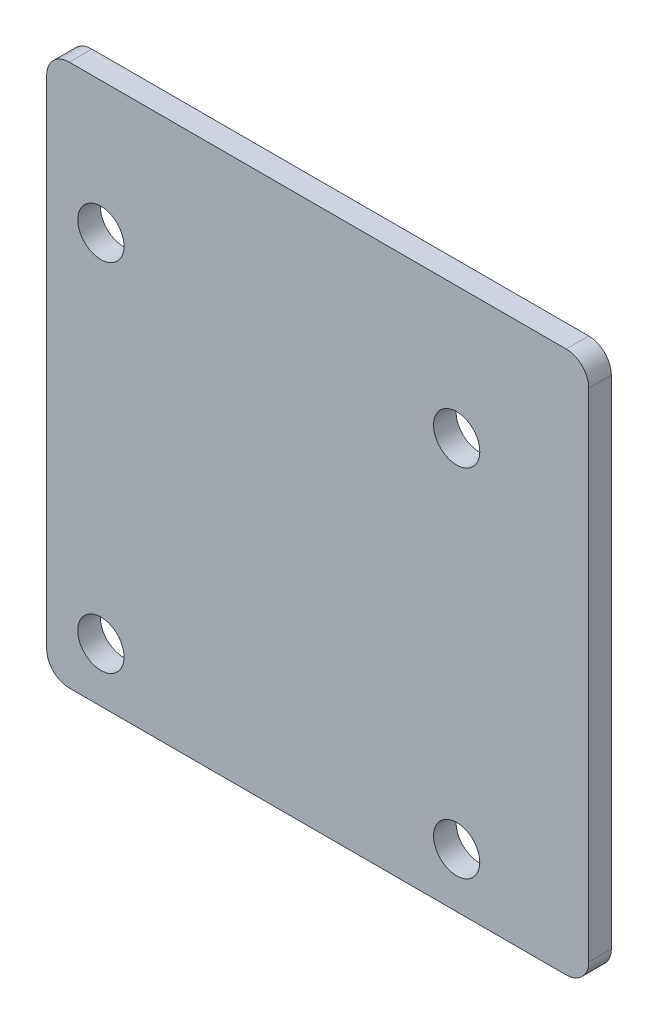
ISO-10303-21;
HEADER;
FILE_DESCRIPTION(('STEP AP214'),'2;1');
FILE_NAME('part.step','',(''),(''),'','','');
FILE_SCHEMA(('AUTOMOTIVE_DESIGN { 1 0 10303 214 1 1 1 1 }'));
ENDSEC;
DATA;
#1=APPLICATION_CONTEXT('core data for automotive mechanical design processes');
#2=APPLICATION_PROTOCOL_DEFINITION('international standard','automotive_design',2000,#1);
#3=PRODUCT_CONTEXT('',#1,'mechanical');
#4=PRODUCT('Part','Part','',(#3));
#5=PRODUCT_RELATED_PRODUCT_CATEGORY('part','',(#4));
#6=PRODUCT_DEFINITION_FORMATION('','',#4);
#7=PRODUCT_DEFINITION_CONTEXT('part definition',#1,'design');
#8=PRODUCT_DEFINITION('design','',#6,#7);
#9=PRODUCT_DEFINITION_SHAPE('','',#8);
#10=(LENGTH_UNIT() NAMED_UNIT(*) SI_UNIT(.MILLI.,.METRE.));
#11=(NAMED_UNIT(*) PLANE_ANGLE_UNIT() SI_UNIT($,.RADIAN.));
#12=(NAMED_UNIT(*) SI_UNIT($,.STERADIAN.) SOLID_ANGLE_UNIT());
#13=UNCERTAINTY_MEASURE_WITH_UNIT(LENGTH_MEASURE(1.E-05),#10,'distance_accuracy_value','');
#14=(GEOMETRIC_REPRESENTATION_CONTEXT(3) GLOBAL_UNCERTAINTY_ASSIGNED_CONTEXT((#13)) GLOBAL_UNIT_ASSIGNED_CONTEXT((#10,
#11,#12)) REPRESENTATION_CONTEXT('',''));
#15=CARTESIAN_POINT('',(0.,0.,0.));
#16=DIRECTION('',(0.,0.,1.));
#17=DIRECTION('',(1.,0.,0.));
#18=AXIS2_PLACEMENT_3D('',#15,#16,#17);
#19=CARTESIAN_POINT('',(-73.025,34.925,-3.175));
#20=DIRECTION('',(0.,0.,-1.));
#21=DIRECTION('',(-1.,0.,0.));
#22=AXIS2_PLACEMENT_3D('',#19,#20,#21);
#23=PLANE('',#22);
#24=CARTESIAN_POINT('',(-18.5674,-30.48,-3.17500000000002));
#25=DIRECTION('',(0.,0.,1.));
#26=DIRECTION('',(1.,0.,0.));
#27=AXIS2_PLACEMENT_3D('',#24,#25,#26);
#28=CIRCLE('',#27,3.2512);
#29=CARTESIAN_POINT('',(-15.3162,-30.48,-3.17500000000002));
#30=VERTEX_POINT('',#29);
#31=EDGE_CURVE('E210',#30,#30,#28,.T.);
#32=ORIENTED_EDGE('',*,*,#31,.T.);
#33=EDGE_LOOP('',(#32));
#34=FACE_BOUND('',#33,.T.);
#35=CARTESIAN_POINT('',(-18.5674,19.5326,-3.17500000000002));
#36=DIRECTION('',(0.,0.,1.));
#37=DIRECTION('',(1.,0.,0.));
#38=AXIS2_PLACEMENT_3D('',#35,#36,#37);
#39=CIRCLE('',#38,3.2512);
#40=CARTESIAN_POINT('',(-15.3162,19.5326,-3.17500000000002));
#41=VERTEX_POINT('',#40);
#42=EDGE_CURVE('E204',#41,#41,#39,.T.);
#43=ORIENTED_EDGE('',*,*,#42,.T.);
#44=EDGE_LOOP('',(#43));
#45=FACE_BOUND('',#44,.T.);
#46=CARTESIAN_POINT('',(-73.025,34.925,-3.175));
#47=DIRECTION('',(0.,0.,-1.));
#48=DIRECTION('',(-1.,0.,0.));
#49=AXIS2_PLACEMENT_3D('',#46,#47,#48);
#50=CIRCLE('',#49,3.17500000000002);
#51=CARTESIAN_POINT('',(-76.2,34.925,-3.175));
#52=VERTEX_POINT('',#51);
#53=CARTESIAN_POINT('',(-73.025,38.1,-3.175));
#54=VERTEX_POINT('',#53);
#55=EDGE_CURVE('E156',#52,#54,#50,.T.);
#56=ORIENTED_EDGE('',*,*,#55,.T.);
#57=DIRECTION('',(1.,0.,0.));
#58=VECTOR('',#57,1.);
#59=CARTESIAN_POINT('',(-3.17499999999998,38.1,-3.175));
#60=LINE('',#59,#58);
#61=CARTESIAN_POINT('',(-3.17499999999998,38.1,-3.175));
#62=VERTEX_POINT('',#61);
#63=EDGE_CURVE('E104',#54,#62,#60,.T.);
#64=ORIENTED_EDGE('',*,*,#63,.T.);
#65=CARTESIAN_POINT('',(-3.17499999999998,34.925,-3.175));
#66=DIRECTION('',(0.,0.,-1.));
#67=DIRECTION('',(1.,0.,0.));
#68=AXIS2_PLACEMENT_3D('',#65,#66,#67);
#69=CIRCLE('',#68,3.175);
#70=CARTESIAN_POINT('',(0.,34.925,-3.175));
#71=VERTEX_POINT('',#70);
#72=EDGE_CURVE('E171',#62,#71,#69,.T.);
#73=ORIENTED_EDGE('',*,*,#72,.T.);
#74=DIRECTION('',(0.,-1.,0.));
#75=VECTOR('',#74,1.);
#76=CARTESIAN_POINT('',(0.,-34.925,-3.175));
#77=LINE('',#76,#75);
#78=CARTESIAN_POINT('',(0.,-34.925,-3.175));
#79=VERTEX_POINT('',#78);
#80=EDGE_CURVE('E184',#71,#79,#77,.T.);
#81=ORIENTED_EDGE('',*,*,#80,.T.);
#82=CARTESIAN_POINT('',(-3.175,-34.925,-3.175));
#83=DIRECTION('',(0.,0.,-1.));
#84=DIRECTION('',(-1.,0.,0.));
#85=AXIS2_PLACEMENT_3D('',#82,#83,#84);
#86=CIRCLE('',#85,3.175);
#87=CARTESIAN_POINT('',(-3.175,-38.1,-3.175));
#88=VERTEX_POINT('',#87);
#89=EDGE_CURVE('E123',#79,#88,#86,.T.);
#90=ORIENTED_EDGE('',*,*,#89,.T.);
#91=DIRECTION('',(-1.,0.,0.));
#92=VECTOR('',#91,1.);
#93=CARTESIAN_POINT('',(-3.175,-38.1,-3.175));
#94=LINE('',#93,#92);
#95=CARTESIAN_POINT('',(-73.025,-38.1,-3.175));
#96=VERTEX_POINT('',#95);
#97=EDGE_CURVE('E117',#88,#96,#94,.T.);
#98=ORIENTED_EDGE('',*,*,#97,.T.);
#99=CARTESIAN_POINT('',(-73.025,-34.925,-3.175));
#100=DIRECTION('',(0.,0.,-1.));
#101=DIRECTION('',(-1.,0.,0.));
#102=AXIS2_PLACEMENT_3D('',#99,#100,#101);
#103=CIRCLE('',#102,3.17500000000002);
#104=CARTESIAN_POINT('',(-76.2,-34.925,-3.175));
#105=VERTEX_POINT('',#104);
#106=EDGE_CURVE('E121',#96,#105,#103,.T.);
#107=ORIENTED_EDGE('',*,*,#106,.T.);
#108=DIRECTION('',(0.,1.,0.));
#109=VECTOR('',#108,1.);
#110=CARTESIAN_POINT('',(-76.2,-34.925,-3.175));
#111=LINE('',#110,#109);
#112=EDGE_CURVE('E61',#105,#52,#111,.T.);
#113=ORIENTED_EDGE('',*,*,#112,.T.);
#114=EDGE_LOOP('',(#56,#64,#73,#81,#90,#98,#107,#113));
#115=FACE_BOUND('',#114,.T.);
#116=CARTESIAN_POINT('',(-68.58,-30.48,-3.17500000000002));
#117=DIRECTION('',(0.,0.,1.));
#118=DIRECTION('',(1.,0.,0.));
#119=AXIS2_PLACEMENT_3D('',#116,#117,#118);
#120=CIRCLE('',#119,3.2512);
#121=CARTESIAN_POINT('',(-65.3288,-30.48,-3.17500000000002));
#122=VERTEX_POINT('',#121);
#123=EDGE_CURVE('E192',#122,#122,#120,.T.);
#124=ORIENTED_EDGE('',*,*,#123,.T.);
#125=EDGE_LOOP('',(#124));
#126=FACE_BOUND('',#125,.T.);
#127=CARTESIAN_POINT('',(-68.58,19.5326,-3.17500000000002));
#128=DIRECTION('',(0.,0.,1.));
#129=DIRECTION('',(1.,0.,0.));
#130=AXIS2_PLACEMENT_3D('',#127,#128,#129);
#131=CIRCLE('',#130,3.2512);
#132=CARTESIAN_POINT('',(-65.3288,19.5326,-3.17500000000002));
#133=VERTEX_POINT('',#132);
#134=EDGE_CURVE('E198',#133,#133,#131,.T.);
#135=ORIENTED_EDGE('',*,*,#134,.T.);
#136=EDGE_LOOP('',(#135));
#137=FACE_BOUND('',#136,.T.);
#138=ADVANCED_FACE('F44',(#34,#45,#115,#126,#137),#23,.T.);
#139=CARTESIAN_POINT('',(-73.025,34.925,0.));
#140=DIRECTION('',(0.,0.,-1.));
#141=DIRECTION('',(-1.,0.,0.));
#142=AXIS2_PLACEMENT_3D('',#139,#140,#141);
#143=PLANE('',#142);
#144=CARTESIAN_POINT('',(-18.5674,-30.48,0.));
#145=DIRECTION('',(0.,0.,1.));
#146=DIRECTION('',(1.,0.,0.));
#147=AXIS2_PLACEMENT_3D('',#144,#145,#146);
#148=CIRCLE('',#147,3.2512);
#149=CARTESIAN_POINT('',(-15.3162,-30.48,0.));
#150=VERTEX_POINT('',#149);
#151=EDGE_CURVE('E207',#150,#150,#148,.T.);
#152=ORIENTED_EDGE('',*,*,#151,.F.);
#153=EDGE_LOOP('',(#152));
#154=FACE_BOUND('',#153,.T.);
#155=CARTESIAN_POINT('',(-18.5674,19.5326,0.));
#156=DIRECTION('',(0.,0.,1.));
#157=DIRECTION('',(1.,0.,0.));
#158=AXIS2_PLACEMENT_3D('',#155,#156,#157);
#159=CIRCLE('',#158,3.2512);
#160=CARTESIAN_POINT('',(-15.3162,19.5326,0.));
#161=VERTEX_POINT('',#160);
#162=EDGE_CURVE('E201',#161,#161,#159,.T.);
#163=ORIENTED_EDGE('',*,*,#162,.F.);
#164=EDGE_LOOP('',(#163));
#165=FACE_BOUND('',#164,.T.);
#166=CARTESIAN_POINT('',(-68.58,19.5326,0.));
#167=DIRECTION('',(0.,0.,1.));
#168=DIRECTION('',(1.,0.,0.));
#169=AXIS2_PLACEMENT_3D('',#166,#167,#168);
#170=CIRCLE('',#169,3.2512);
#171=CARTESIAN_POINT('',(-65.3288,19.5326,0.));
#172=VERTEX_POINT('',#171);
#173=EDGE_CURVE('E195',#172,#172,#170,.T.);
#174=ORIENTED_EDGE('',*,*,#173,.F.);
#175=EDGE_LOOP('',(#174));
#176=FACE_BOUND('',#175,.T.);
#177=CARTESIAN_POINT('',(-73.025,34.925,0.));
#178=DIRECTION('',(0.,0.,-1.));
#179=DIRECTION('',(-1.,0.,0.));
#180=AXIS2_PLACEMENT_3D('',#177,#178,#179);
#181=CIRCLE('',#180,3.17500000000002);
#182=CARTESIAN_POINT('',(-76.2,34.925,0.));
#183=VERTEX_POINT('',#182);
#184=CARTESIAN_POINT('',(-73.025,38.1,0.));
#185=VERTEX_POINT('',#184);
#186=EDGE_CURVE('E141',#183,#185,#181,.T.);
#187=ORIENTED_EDGE('',*,*,#186,.F.);
#188=DIRECTION('',(0.,1.,0.));
#189=VECTOR('',#188,1.);
#190=CARTESIAN_POINT('',(-76.2,-34.925,0.));
#191=LINE('',#190,#189);
#192=CARTESIAN_POINT('',(-76.2,-34.925,0.));
#193=VERTEX_POINT('',#192);
#194=EDGE_CURVE('E96',#193,#183,#191,.T.);
#195=ORIENTED_EDGE('',*,*,#194,.F.);
#196=CARTESIAN_POINT('',(-73.025,-34.925,0.));
#197=DIRECTION('',(0.,0.,-1.));
#198=DIRECTION('',(-1.,0.,0.));
#199=AXIS2_PLACEMENT_3D('',#196,#197,#198);
#200=CIRCLE('',#199,3.17500000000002);
#201=CARTESIAN_POINT('',(-73.025,-38.1,0.));
#202=VERTEX_POINT('',#201);
#203=EDGE_CURVE('E90',#202,#193,#200,.T.);
#204=ORIENTED_EDGE('',*,*,#203,.F.);
#205=DIRECTION('',(-1.,0.,0.));
#206=VECTOR('',#205,1.);
#207=CARTESIAN_POINT('',(-3.175,-38.1,0.));
#208=LINE('',#207,#206);
#209=CARTESIAN_POINT('',(-3.175,-38.1,0.));
#210=VERTEX_POINT('',#209);
#211=EDGE_CURVE('E131',#210,#202,#208,.T.);
#212=ORIENTED_EDGE('',*,*,#211,.F.);
#213=CARTESIAN_POINT('',(-3.175,-34.925,0.));
#214=DIRECTION('',(0.,0.,-1.));
#215=DIRECTION('',(-1.,0.,0.));
#216=AXIS2_PLACEMENT_3D('',#213,#214,#215);
#217=CIRCLE('',#216,3.175);
#218=CARTESIAN_POINT('',(0.,-34.925,0.));
#219=VERTEX_POINT('',#218);
#220=EDGE_CURVE('E151',#219,#210,#217,.T.);
#221=ORIENTED_EDGE('',*,*,#220,.F.);
#222=DIRECTION('',(0.,-1.,0.));
#223=VECTOR('',#222,1.);
#224=CARTESIAN_POINT('',(0.,-34.925,0.));
#225=LINE('',#224,#223);
#226=CARTESIAN_POINT('',(0.,34.925,0.));
#227=VERTEX_POINT('',#226);
#228=EDGE_CURVE('E149',#227,#219,#225,.T.);
#229=ORIENTED_EDGE('',*,*,#228,.F.);
#230=CARTESIAN_POINT('',(-3.17499999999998,34.925,0.));
#231=DIRECTION('',(0.,0.,-1.));
#232=DIRECTION('',(1.,0.,0.));
#233=AXIS2_PLACEMENT_3D('',#230,#231,#232);
#234=CIRCLE('',#233,3.175);
#235=CARTESIAN_POINT('',(-3.17499999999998,38.1,0.));
#236=VERTEX_POINT('',#235);
#237=EDGE_CURVE('E147',#236,#227,#234,.T.);
#238=ORIENTED_EDGE('',*,*,#237,.F.);
#239=DIRECTION('',(1.,0.,0.));
#240=VECTOR('',#239,1.);
#241=CARTESIAN_POINT('',(-3.17499999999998,38.1,0.));
#242=LINE('',#241,#240);
#243=EDGE_CURVE('E144',#185,#236,#242,.T.);
#244=ORIENTED_EDGE('',*,*,#243,.F.);
#245=EDGE_LOOP('',(#187,#195,#204,#212,#221,#229,#238,#244));
#246=FACE_BOUND('',#245,.T.);
#247=CARTESIAN_POINT('',(-68.58,-30.48,0.));
#248=DIRECTION('',(0.,0.,1.));
#249=DIRECTION('',(1.,0.,0.));
#250=AXIS2_PLACEMENT_3D('',#247,#248,#249);
#251=CIRCLE('',#250,3.2512);
#252=CARTESIAN_POINT('',(-65.3288,-30.48,0.));
#253=VERTEX_POINT('',#252);
#254=EDGE_CURVE('E145',#253,#253,#251,.T.);
#255=ORIENTED_EDGE('',*,*,#254,.F.);
#256=EDGE_LOOP('',(#255));
#257=FACE_BOUND('',#256,.T.);
#258=ADVANCED_FACE('F175',(#154,#165,#176,#246,#257),#143,.F.);
#259=CARTESIAN_POINT('',(-73.025,34.925,-3.175));
#260=DIRECTION('',(0.,0.,1.));
#261=DIRECTION('',(1.,0.,0.));
#262=AXIS2_PLACEMENT_3D('',#259,#260,#261);
#263=CYLINDRICAL_SURFACE('',#262,3.17500000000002);
#264=ORIENTED_EDGE('',*,*,#186,.T.);
#265=DIRECTION('',(0.,0.,1.));
#266=VECTOR('',#265,1.);
#267=CARTESIAN_POINT('',(-73.025,38.1,-3.175));
#268=LINE('',#267,#266);
#269=EDGE_CURVE('E13',#54,#185,#268,.T.);
#270=ORIENTED_EDGE('',*,*,#269,.F.);
#271=ORIENTED_EDGE('',*,*,#55,.F.);
#272=DIRECTION('',(0.,0.,1.));
#273=VECTOR('',#272,1.);
#274=CARTESIAN_POINT('',(-76.2,34.925,-3.175));
#275=LINE('',#274,#273);
#276=EDGE_CURVE('E137',#52,#183,#275,.T.);
#277=ORIENTED_EDGE('',*,*,#276,.T.);
#278=EDGE_LOOP('',(#264,#270,#271,#277));
#279=FACE_BOUND('',#278,.T.);
#280=ADVANCED_FACE('F46',(#279),#263,.T.);
#281=CARTESIAN_POINT('',(-3.17499999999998,38.1,-3.175));
#282=DIRECTION('',(0.,-1.,0.));
#283=DIRECTION('',(1.,0.,0.));
#284=AXIS2_PLACEMENT_3D('',#281,#282,#283);
#285=PLANE('',#284);
#286=ORIENTED_EDGE('',*,*,#243,.T.);
#287=DIRECTION('',(0.,0.,1.));
#288=VECTOR('',#287,1.);
#289=CARTESIAN_POINT('',(-3.17499999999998,38.1,-3.175));
#290=LINE('',#289,#288);
#291=EDGE_CURVE('E53',#62,#236,#290,.T.);
#292=ORIENTED_EDGE('',*,*,#291,.F.);
#293=ORIENTED_EDGE('',*,*,#63,.F.);
#294=ORIENTED_EDGE('',*,*,#269,.T.);
#295=EDGE_LOOP('',(#286,#292,#293,#294));
#296=FACE_BOUND('',#295,.T.);
#297=ADVANCED_FACE('F261',(#296),#285,.F.);
#298=CARTESIAN_POINT('',(-3.17499999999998,34.925,-3.175));
#299=DIRECTION('',(0.,0.,1.));
#300=DIRECTION('',(1.,0.,0.));
#301=AXIS2_PLACEMENT_3D('',#298,#299,#300);
#302=CYLINDRICAL_SURFACE('',#301,3.175);
#303=ORIENTED_EDGE('',*,*,#237,.T.);
#304=DIRECTION('',(0.,0.,1.));
#305=VECTOR('',#304,1.);
#306=CARTESIAN_POINT('',(0.,34.925,-3.175));
#307=LINE('',#306,#305);
#308=EDGE_CURVE('E163',#71,#227,#307,.T.);
#309=ORIENTED_EDGE('',*,*,#308,.F.);
#310=ORIENTED_EDGE('',*,*,#72,.F.);
#311=ORIENTED_EDGE('',*,*,#291,.T.);
#312=EDGE_LOOP('',(#303,#309,#310,#311));
#313=FACE_BOUND('',#312,.T.);
#314=ADVANCED_FACE('F169',(#313),#302,.T.);
#315=CARTESIAN_POINT('',(0.,-34.925,-3.175));
#316=DIRECTION('',(-1.,0.,0.));
#317=DIRECTION('',(0.,-1.,0.));
#318=AXIS2_PLACEMENT_3D('',#315,#316,#317);
#319=PLANE('',#318);
#320=ORIENTED_EDGE('',*,*,#228,.T.);
#321=DIRECTION('',(0.,0.,1.));
#322=VECTOR('',#321,1.);
#323=CARTESIAN_POINT('',(0.,-34.925,-3.175));
#324=LINE('',#323,#322);
#325=EDGE_CURVE('E160',#79,#219,#324,.T.);
#326=ORIENTED_EDGE('',*,*,#325,.F.);
#327=ORIENTED_EDGE('',*,*,#80,.F.);
#328=ORIENTED_EDGE('',*,*,#308,.T.);
#329=EDGE_LOOP('',(#320,#326,#327,#328));
#330=FACE_BOUND('',#329,.T.);
#331=ADVANCED_FACE('F180',(#330),#319,.F.);
#332=CARTESIAN_POINT('',(-3.175,-34.925,-3.175));
#333=DIRECTION('',(0.,0.,1.));
#334=DIRECTION('',(1.,0.,0.));
#335=AXIS2_PLACEMENT_3D('',#332,#333,#334);
#336=CYLINDRICAL_SURFACE('',#335,3.175);
#337=ORIENTED_EDGE('',*,*,#220,.T.);
#338=DIRECTION('',(0.,0.,1.));
#339=VECTOR('',#338,1.);
#340=CARTESIAN_POINT('',(-3.175,-38.1,-3.175));
#341=LINE('',#340,#339);
#342=EDGE_CURVE('E132',#88,#210,#341,.T.);
#343=ORIENTED_EDGE('',*,*,#342,.F.);
#344=ORIENTED_EDGE('',*,*,#89,.F.);
#345=ORIENTED_EDGE('',*,*,#325,.T.);
#346=EDGE_LOOP('',(#337,#343,#344,#345));
#347=FACE_BOUND('',#346,.T.);
#348=ADVANCED_FACE('F183',(#347),#336,.T.);
#349=CARTESIAN_POINT('',(-3.175,-38.1,-3.175));
#350=DIRECTION('',(0.,1.,0.));
#351=DIRECTION('',(-1.,0.,0.));
#352=AXIS2_PLACEMENT_3D('',#349,#350,#351);
#353=PLANE('',#352);
#354=ORIENTED_EDGE('',*,*,#211,.T.);
#355=DIRECTION('',(0.,0.,1.));
#356=VECTOR('',#355,1.);
#357=CARTESIAN_POINT('',(-73.025,-38.1,-3.175));
#358=LINE('',#357,#356);
#359=EDGE_CURVE('E128',#96,#202,#358,.T.);
#360=ORIENTED_EDGE('',*,*,#359,.F.);
#361=ORIENTED_EDGE('',*,*,#97,.F.);
#362=ORIENTED_EDGE('',*,*,#342,.T.);
#363=EDGE_LOOP('',(#354,#360,#361,#362));
#364=FACE_BOUND('',#363,.T.);
#365=ADVANCED_FACE('F129',(#364),#353,.F.);
#366=CARTESIAN_POINT('',(-73.025,-34.925,-3.175));
#367=DIRECTION('',(0.,0.,1.));
#368=DIRECTION('',(1.,0.,0.));
#369=AXIS2_PLACEMENT_3D('',#366,#367,#368);
#370=CYLINDRICAL_SURFACE('',#369,3.17500000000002);
#371=ORIENTED_EDGE('',*,*,#203,.T.);
#372=DIRECTION('',(0.,0.,1.));
#373=VECTOR('',#372,1.);
#374=CARTESIAN_POINT('',(-76.2,-34.925,-3.175));
#375=LINE('',#374,#373);
#376=EDGE_CURVE('E133',#105,#193,#375,.T.);
#377=ORIENTED_EDGE('',*,*,#376,.F.);
#378=ORIENTED_EDGE('',*,*,#106,.F.);
#379=ORIENTED_EDGE('',*,*,#359,.T.);
#380=EDGE_LOOP('',(#371,#377,#378,#379));
#381=FACE_BOUND('',#380,.T.);
#382=ADVANCED_FACE('F135',(#381),#370,.T.);
#383=CARTESIAN_POINT('',(-76.2,-34.925,-3.175));
#384=DIRECTION('',(1.,0.,0.));
#385=DIRECTION('',(0.,1.,0.));
#386=AXIS2_PLACEMENT_3D('',#383,#384,#385);
#387=PLANE('',#386);
#388=ORIENTED_EDGE('',*,*,#194,.T.);
#389=ORIENTED_EDGE('',*,*,#276,.F.);
#390=ORIENTED_EDGE('',*,*,#112,.F.);
#391=ORIENTED_EDGE('',*,*,#376,.T.);
#392=EDGE_LOOP('',(#388,#389,#390,#391));
#393=FACE_BOUND('',#392,.T.);
#394=ADVANCED_FACE('F241',(#393),#387,.F.);
#395=CARTESIAN_POINT('',(-68.58,-30.48,0.));
#396=DIRECTION('',(0.,0.,1.));
#397=DIRECTION('',(1.,0.,0.));
#398=AXIS2_PLACEMENT_3D('',#395,#396,#397);
#399=CYLINDRICAL_SURFACE('',#398,3.2512);
#400=ORIENTED_EDGE('',*,*,#123,.F.);
#401=EDGE_LOOP('',(#400));
#402=FACE_BOUND('',#401,.T.);
#403=ORIENTED_EDGE('',*,*,#254,.T.);
#404=EDGE_LOOP('',(#403));
#405=FACE_BOUND('',#404,.T.);
#406=ADVANCED_FACE('F232',(#402,#405),#399,.F.);
#407=CARTESIAN_POINT('',(-68.58,19.5326,0.));
#408=DIRECTION('',(0.,0.,1.));
#409=DIRECTION('',(1.,0.,0.));
#410=AXIS2_PLACEMENT_3D('',#407,#408,#409);
#411=CYLINDRICAL_SURFACE('',#410,3.2512);
#412=ORIENTED_EDGE('',*,*,#134,.F.);
#413=EDGE_LOOP('',(#412));
#414=FACE_BOUND('',#413,.T.);
#415=ORIENTED_EDGE('',*,*,#173,.T.);
#416=EDGE_LOOP('',(#415));
#417=FACE_BOUND('',#416,.T.);
#418=ADVANCED_FACE('F230',(#414,#417),#411,.F.);
#419=CARTESIAN_POINT('',(-18.5674,19.5326,0.));
#420=DIRECTION('',(0.,0.,1.));
#421=DIRECTION('',(1.,0.,0.));
#422=AXIS2_PLACEMENT_3D('',#419,#420,#421);
#423=CYLINDRICAL_SURFACE('',#422,3.2512);
#424=ORIENTED_EDGE('',*,*,#42,.F.);
#425=EDGE_LOOP('',(#424));
#426=FACE_BOUND('',#425,.T.);
#427=ORIENTED_EDGE('',*,*,#162,.T.);
#428=EDGE_LOOP('',(#427));
#429=FACE_BOUND('',#428,.T.);
#430=ADVANCED_FACE('F219',(#426,#429),#423,.F.);
#431=CARTESIAN_POINT('',(-18.5674,-30.48,0.));
#432=DIRECTION('',(0.,0.,1.));
#433=DIRECTION('',(1.,0.,0.));
#434=AXIS2_PLACEMENT_3D('',#431,#432,#433);
#435=CYLINDRICAL_SURFACE('',#434,3.2512);
#436=ORIENTED_EDGE('',*,*,#31,.F.);
#437=EDGE_LOOP('',(#436));
#438=FACE_BOUND('',#437,.T.);
#439=ORIENTED_EDGE('',*,*,#151,.T.);
#440=EDGE_LOOP('',(#439));
#441=FACE_BOUND('',#440,.T.);
#442=ADVANCED_FACE('F216',(#438,#441),#435,.F.);
#443=CLOSED_SHELL('',(#138,#258,#280,#297,#314,#331,#348,#365,#382,#394,#406,#418,#430,#442));
#444=MANIFOLD_SOLID_BREP('B2',#443);
#445=ADVANCED_BREP_SHAPE_REPRESENTATION('',(#18,#444),#14);
#446=SHAPE_DEFINITION_REPRESENTATION(#9,#445);
ENDSEC;
END-ISO-10303-21;
